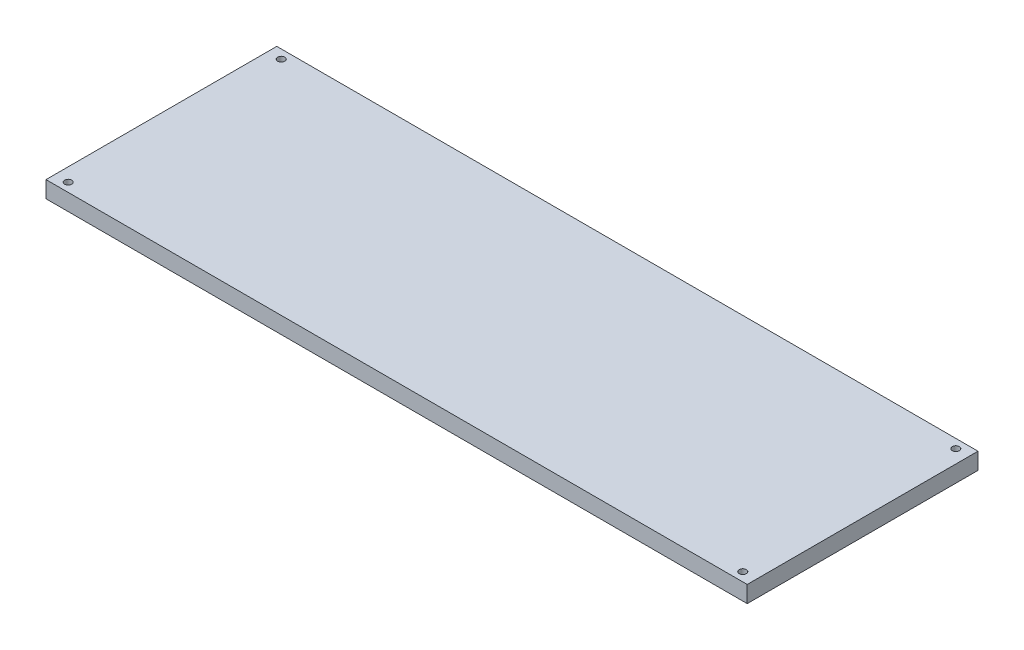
from build123d import *

# Parameters (mm, degrees)
SKETCH1_W                  = 501.65
SKETCH1_H                  = 165.1
BOSS_EXTRUDE1_DEPTH        = 11.90625
F_7_0_201_DIAMETER_HOLE1_D = 5.1054


with BuildPart() as part:
    # Sketch1 → Boss-Extrude1 (new body)
    with BuildSketch(Plane(origin=(0, 0, 0), x_dir=(1, 0, 0), z_dir=(0, 1, 0))):
        Rectangle(SKETCH1_W, SKETCH1_H)
    extrude(amount=BOSS_EXTRUDE1_DEPTH)

    # 7 _0.201_ Diameter Hole1 (through all)
    with Locations(Plane(origin=(0, 11.90625, 0), x_dir=(1, 0, 0), z_dir=(0, 1, 0))):
        with Locations((-241.3, 76.2), (241.3, 76.2), (241.3, -76.2), (-241.3, -76.2)):
            Hole(F_7_0_201_DIAMETER_HOLE1_D / 2)


solid = part.part
